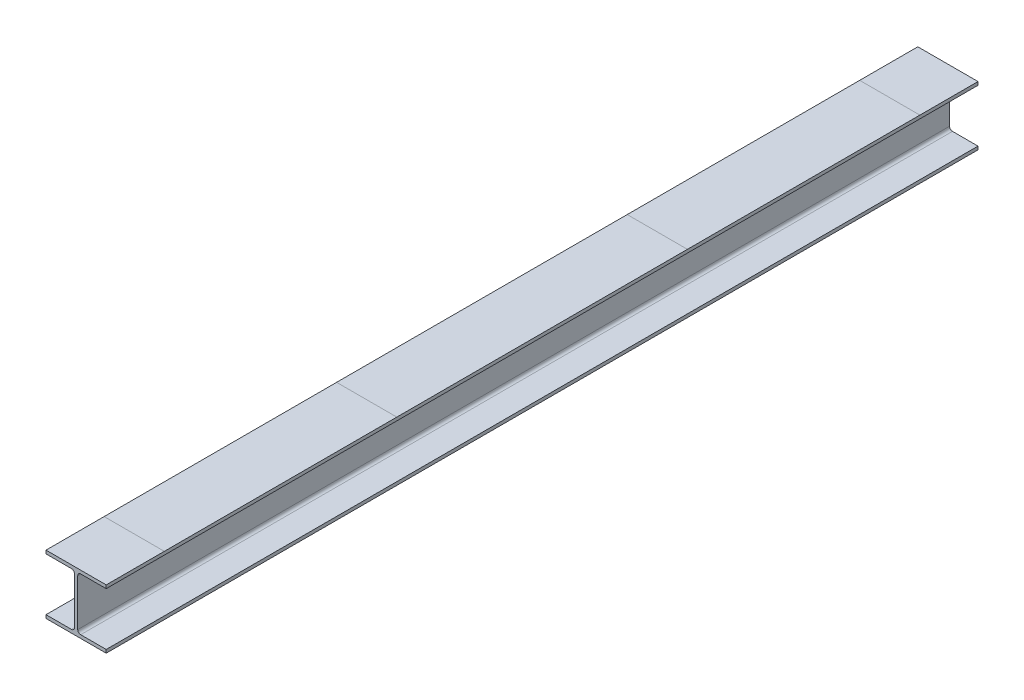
from build123d import *

# Parameters (mm, degrees)
EXTRUIR1_DEPTH = 3000


with BuildPart() as part:
    # Croquis1 → Extruir1 (new body)
    with BuildSketch(Plane.XY):
        with BuildLine():
            Line((-81.28, -8.763), (-81.28, 2.54))
            Line((-81.28, 2.54), (6.477, 2.54))
            ThreePointArc((6.477, 2.54), (13.661204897, 5.515795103), (16.637, 12.7))
            Line((16.637, 12.7), (16.637, 173.482))
            ThreePointArc((16.637, 173.482), (13.661204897, 180.666204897), (6.477, 183.642))
            Line((6.477, 183.642), (-81.28, 183.642))
            Line((-81.28, 183.642), (-81.28, 194.945))
            Line((-81.28, 194.945), (125.857, 194.945))
            Line((125.857, 194.945), (125.857, 183.642))
            Line((125.857, 183.642), (38.1, 183.642))
            ThreePointArc((38.1, 183.642), (30.915795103, 180.666204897), (27.94, 173.482))
            Line((27.94, 173.482), (27.94, 12.7))
            ThreePointArc((27.94, 12.7), (30.915795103, 5.515795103), (38.1, 2.54))
            Line((38.1, 2.54), (125.857, 2.54))
            Line((125.857, 2.54), (125.857, -8.763))
            Line((125.857, -8.763), (-81.28, -8.763))
        make_face()
    extrude(amount=EXTRUIR1_DEPTH)


solid = part.part
